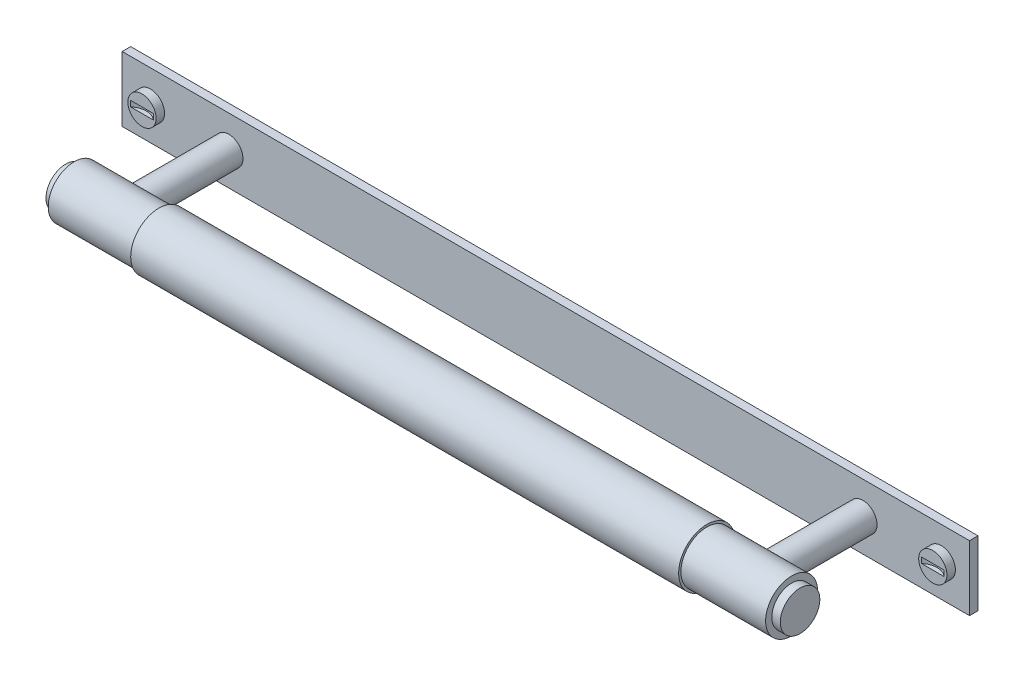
ISO-10303-21;
HEADER;
FILE_DESCRIPTION(('STEP AP214'),'2;1');
FILE_NAME('part.step','',(''),(''),'','','');
FILE_SCHEMA(('AUTOMOTIVE_DESIGN { 1 0 10303 214 1 1 1 1 }'));
ENDSEC;
DATA;
#1=APPLICATION_CONTEXT('core data for automotive mechanical design processes');
#2=APPLICATION_PROTOCOL_DEFINITION('international standard','automotive_design',2000,#1);
#3=PRODUCT_CONTEXT('',#1,'mechanical');
#4=PRODUCT('Part','Part','',(#3));
#5=PRODUCT_RELATED_PRODUCT_CATEGORY('part','',(#4));
#6=PRODUCT_DEFINITION_FORMATION('','',#4);
#7=PRODUCT_DEFINITION_CONTEXT('part definition',#1,'design');
#8=PRODUCT_DEFINITION('design','',#6,#7);
#9=PRODUCT_DEFINITION_SHAPE('','',#8);
#10=(LENGTH_UNIT() NAMED_UNIT(*) SI_UNIT(.MILLI.,.METRE.));
#11=(NAMED_UNIT(*) PLANE_ANGLE_UNIT() SI_UNIT($,.RADIAN.));
#12=(NAMED_UNIT(*) SI_UNIT($,.STERADIAN.) SOLID_ANGLE_UNIT());
#13=UNCERTAINTY_MEASURE_WITH_UNIT(LENGTH_MEASURE(1.E-05),#10,'distance_accuracy_value','');
#14=(GEOMETRIC_REPRESENTATION_CONTEXT(3) GLOBAL_UNCERTAINTY_ASSIGNED_CONTEXT((#13)) GLOBAL_UNIT_ASSIGNED_CONTEXT((#10,
#11,#12)) REPRESENTATION_CONTEXT('',''));
#15=CARTESIAN_POINT('',(0.,0.,0.));
#16=DIRECTION('',(0.,0.,1.));
#17=DIRECTION('',(1.,0.,0.));
#18=AXIS2_PLACEMENT_3D('',#15,#16,#17);
#19=CARTESIAN_POINT('',(150.,-11.5,-40.));
#20=DIRECTION('',(0.,0.,-1.));
#21=DIRECTION('',(-1.,0.,0.));
#22=AXIS2_PLACEMENT_3D('',#19,#20,#21);
#23=PLANE('',#22);
#24=CARTESIAN_POINT('',(-140.,0.,-40.));
#25=DIRECTION('',(0.,0.,-1.));
#26=DIRECTION('',(-1.,0.,0.));
#27=AXIS2_PLACEMENT_3D('',#24,#25,#26);
#28=CIRCLE('',#27,4.99999999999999);
#29=CARTESIAN_POINT('',(-145.,0.,-40.));
#30=VERTEX_POINT('',#29);
#31=EDGE_CURVE('E112',#30,#30,#28,.T.);
#32=ORIENTED_EDGE('',*,*,#31,.T.);
#33=EDGE_LOOP('',(#32));
#34=FACE_BOUND('',#33,.T.);
#35=CARTESIAN_POINT('',(112.25,0.,-40.));
#36=DIRECTION('',(0.,0.,-1.));
#37=DIRECTION('',(-1.,0.,0.));
#38=AXIS2_PLACEMENT_3D('',#35,#36,#37);
#39=CIRCLE('',#38,4.99999999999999);
#40=CARTESIAN_POINT('',(107.25,0.,-40.));
#41=VERTEX_POINT('',#40);
#42=EDGE_CURVE('E166',#41,#41,#39,.T.);
#43=ORIENTED_EDGE('',*,*,#42,.T.);
#44=EDGE_LOOP('',(#43));
#45=FACE_BOUND('',#44,.T.);
#46=DIRECTION('',(0.,-1.,0.));
#47=VECTOR('',#46,1.);
#48=CARTESIAN_POINT('',(-150.,-11.5,-40.));
#49=LINE('',#48,#47);
#50=CARTESIAN_POINT('',(-150.,11.5,-40.));
#51=VERTEX_POINT('',#50);
#52=CARTESIAN_POINT('',(-150.,-11.5,-40.));
#53=VERTEX_POINT('',#52);
#54=EDGE_CURVE('E149',#51,#53,#49,.T.);
#55=ORIENTED_EDGE('',*,*,#54,.T.);
#56=DIRECTION('',(-1.,0.,0.));
#57=VECTOR('',#56,1.);
#58=CARTESIAN_POINT('',(150.,-11.5,-40.));
#59=LINE('',#58,#57);
#60=CARTESIAN_POINT('',(150.,-11.5,-40.));
#61=VERTEX_POINT('',#60);
#62=EDGE_CURVE('E154',#61,#53,#59,.T.);
#63=ORIENTED_EDGE('',*,*,#62,.F.);
#64=DIRECTION('',(0.,-1.,0.));
#65=VECTOR('',#64,1.);
#66=CARTESIAN_POINT('',(150.,-11.5,-40.));
#67=LINE('',#66,#65);
#68=CARTESIAN_POINT('',(150.,11.5,-40.));
#69=VERTEX_POINT('',#68);
#70=EDGE_CURVE('E140',#69,#61,#67,.T.);
#71=ORIENTED_EDGE('',*,*,#70,.F.);
#72=DIRECTION('',(-1.,0.,0.));
#73=VECTOR('',#72,1.);
#74=CARTESIAN_POINT('',(150.,11.5,-40.));
#75=LINE('',#74,#73);
#76=EDGE_CURVE('E157',#69,#51,#75,.T.);
#77=ORIENTED_EDGE('',*,*,#76,.T.);
#78=EDGE_LOOP('',(#55,#63,#71,#77));
#79=FACE_BOUND('',#78,.T.);
#80=CARTESIAN_POINT('',(-112.25,0.,-40.));
#81=DIRECTION('',(0.,0.,-1.));
#82=DIRECTION('',(-1.,0.,0.));
#83=AXIS2_PLACEMENT_3D('',#80,#81,#82);
#84=CIRCLE('',#83,4.99999999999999);
#85=CARTESIAN_POINT('',(-117.25,0.,-40.));
#86=VERTEX_POINT('',#85);
#87=EDGE_CURVE('E163',#86,#86,#84,.F.);
#88=ORIENTED_EDGE('',*,*,#87,.F.);
#89=EDGE_LOOP('',(#88));
#90=FACE_BOUND('',#89,.T.);
#91=CARTESIAN_POINT('',(140.,0.,-40.));
#92=DIRECTION('',(0.,0.,-1.));
#93=DIRECTION('',(-1.,0.,0.));
#94=AXIS2_PLACEMENT_3D('',#91,#92,#93);
#95=CIRCLE('',#94,4.99999999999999);
#96=CARTESIAN_POINT('',(135.,0.,-40.));
#97=VERTEX_POINT('',#96);
#98=EDGE_CURVE('E286',#97,#97,#95,.F.);
#99=ORIENTED_EDGE('',*,*,#98,.F.);
#100=EDGE_LOOP('',(#99));
#101=FACE_BOUND('',#100,.T.);
#102=ADVANCED_FACE('F33',(#34,#45,#79,#90,#101),#23,.F.);
#103=CARTESIAN_POINT('',(127.,0.,0.));
#104=DIRECTION('',(-1.,0.,0.));
#105=DIRECTION('',(0.,0.,1.));
#106=AXIS2_PLACEMENT_3D('',#103,#104,#105);
#107=CYLINDRICAL_SURFACE('',#106,9.2);
#108=CARTESIAN_POINT('',(97.,0.,0.));
#109=DIRECTION('',(1.,0.,0.));
#110=DIRECTION('',(0.,0.,-1.));
#111=AXIS2_PLACEMENT_3D('',#108,#109,#110);
#112=CIRCLE('',#111,9.2);
#113=CARTESIAN_POINT('',(97.,0.,-9.2));
#114=VERTEX_POINT('',#113);
#115=EDGE_CURVE('E182',#114,#114,#112,.T.);
#116=ORIENTED_EDGE('',*,*,#115,.T.);
#117=EDGE_LOOP('',(#116));
#118=FACE_BOUND('',#117,.T.);
#119=CARTESIAN_POINT('',(127.,0.,0.));
#120=DIRECTION('',(1.,0.,0.));
#121=DIRECTION('',(0.,0.,-1.));
#122=AXIS2_PLACEMENT_3D('',#119,#120,#121);
#123=CIRCLE('',#122,9.2);
#124=CARTESIAN_POINT('',(127.,0.,-9.2));
#125=VERTEX_POINT('',#124);
#126=EDGE_CURVE('E185',#125,#125,#123,.T.);
#127=ORIENTED_EDGE('',*,*,#126,.F.);
#128=EDGE_LOOP('',(#127));
#129=FACE_BOUND('',#128,.T.);
#130=CARTESIAN_POINT('',(117.25,0.,-9.2));
#131=CARTESIAN_POINT('',(117.250001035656,-0.130074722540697,-9.20000090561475));
#132=CARTESIAN_POINT('',(117.244919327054,-0.260136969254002,-9.19723589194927));
#133=CARTESIAN_POINT('',(117.224659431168,-0.51928549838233,-9.18624856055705));
#134=CARTESIAN_POINT('',(117.209478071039,-0.648371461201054,-9.17802452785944));
#135=CARTESIAN_POINT('',(117.169189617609,-0.904665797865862,-9.15631689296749));
#136=CARTESIAN_POINT('',(117.144072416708,-1.03187212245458,-9.14282793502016));
#137=CARTESIAN_POINT('',(117.084208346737,-1.28341476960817,-9.11092364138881));
#138=CARTESIAN_POINT('',(117.04945754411,-1.40774989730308,-9.0925062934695));
#139=CARTESIAN_POINT('',(116.970895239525,-1.65213298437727,-9.05128374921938));
#140=CARTESIAN_POINT('',(116.927125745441,-1.77219789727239,-9.02849892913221));
#141=CARTESIAN_POINT('',(116.83086498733,-2.00796183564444,-8.9790104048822));
#142=CARTESIAN_POINT('',(116.778370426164,-2.12365919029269,-8.95230521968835));
#143=CARTESIAN_POINT('',(116.608525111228,-2.46316888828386,-8.86719116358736));
#144=CARTESIAN_POINT('',(116.478734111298,-2.67964052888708,-8.80374126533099));
#145=CARTESIAN_POINT('',(116.179944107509,-3.10276985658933,-8.66405646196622));
#146=CARTESIAN_POINT('',(116.008884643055,-3.30776927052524,-8.58724663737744));
#147=CARTESIAN_POINT('',(115.636938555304,-3.68774436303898,-8.43106083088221));
#148=CARTESIAN_POINT('',(115.436025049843,-3.86269267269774,-8.35168258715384));
#149=CARTESIAN_POINT('',(114.986960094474,-4.19453179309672,-8.19042783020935));
#150=CARTESIAN_POINT('',(114.736128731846,-4.34809630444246,-8.10903821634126));
#151=CARTESIAN_POINT('',(114.340003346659,-4.54463175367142,-7.99949849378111));
#152=CARTESIAN_POINT('',(114.20460087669,-4.60452242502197,-7.96506681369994));
#153=CARTESIAN_POINT('',(113.927917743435,-4.7123873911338,-7.90172843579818));
#154=CARTESIAN_POINT('',(113.786640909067,-4.76036931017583,-7.87281820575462));
#155=CARTESIAN_POINT('',(113.508188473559,-4.84114175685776,-7.82339132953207));
#156=CARTESIAN_POINT('',(113.371306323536,-4.87469290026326,-7.80246375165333));
#157=CARTESIAN_POINT('',(113.094408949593,-4.9302019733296,-7.76750851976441));
#158=CARTESIAN_POINT('',(112.954395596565,-4.95216664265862,-7.75347685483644));
#159=CARTESIAN_POINT('',(112.67258350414,-4.98412633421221,-7.73297147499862));
#160=CARTESIAN_POINT('',(112.530786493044,-4.99413215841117,-7.72649093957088));
#161=CARTESIAN_POINT('',(112.246722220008,-5.0020165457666,-7.72138953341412));
#162=CARTESIAN_POINT('',(112.104455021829,-4.99989669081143,-7.72276763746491));
#163=CARTESIAN_POINT('',(111.841925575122,-4.98478878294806,-7.73252471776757));
#164=CARTESIAN_POINT('',(111.721523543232,-4.97345607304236,-7.73983711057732));
#165=CARTESIAN_POINT('',(111.482260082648,-4.942179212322,-7.75984601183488));
#166=CARTESIAN_POINT('',(111.363399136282,-4.92223242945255,-7.77254416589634));
#167=CARTESIAN_POINT('',(111.12803831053,-4.87397481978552,-7.80289558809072));
#168=CARTESIAN_POINT('',(111.011538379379,-4.84566417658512,-7.82054874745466));
#169=CARTESIAN_POINT('',(110.781543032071,-4.7809962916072,-7.86024868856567));
#170=CARTESIAN_POINT('',(110.668048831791,-4.74463584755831,-7.88229721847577));
#171=CARTESIAN_POINT('',(110.328154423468,-4.62225510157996,-7.95511924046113));
#172=CARTESIAN_POINT('',(110.107319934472,-4.52396510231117,-8.01188661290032));
#173=CARTESIAN_POINT('',(109.684260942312,-4.29821090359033,-8.1352249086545));
#174=CARTESIAN_POINT('',(109.482044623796,-4.17073395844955,-8.20180011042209));
#175=CARTESIAN_POINT('',(109.069163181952,-3.86749973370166,-8.34955553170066));
#176=CARTESIAN_POINT('',(108.86196454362,-3.68733528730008,-8.43140910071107));
#177=CARTESIAN_POINT('',(108.479057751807,-3.29471585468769,-8.59242600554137));
#178=CARTESIAN_POINT('',(108.303370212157,-3.08223989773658,-8.67158755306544));
#179=CARTESIAN_POINT('',(108.061812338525,-2.73508983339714,-8.78495686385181));
#180=CARTESIAN_POINT('',(107.982990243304,-2.61045949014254,-8.82288451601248));
#181=CARTESIAN_POINT('',(107.836257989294,-2.35386813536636,-8.89477478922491));
#182=CARTESIAN_POINT('',(107.768343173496,-2.22191028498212,-8.92873910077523));
#183=CARTESIAN_POINT('',(107.644183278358,-1.95155644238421,-8.99170105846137));
#184=CARTESIAN_POINT('',(107.587932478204,-1.81316364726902,-9.02070113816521));
#185=CARTESIAN_POINT('',(107.487782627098,-1.53091383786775,-9.07286528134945));
#186=CARTESIAN_POINT('',(107.443881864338,-1.38705758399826,-9.09603015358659));
#187=CARTESIAN_POINT('',(107.372513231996,-1.10853590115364,-9.13395050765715));
#188=CARTESIAN_POINT('',(107.343906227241,-0.974240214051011,-9.14928303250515));
#189=CARTESIAN_POINT('',(107.297792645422,-0.703227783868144,-9.17409277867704));
#190=CARTESIAN_POINT('',(107.280284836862,-0.566511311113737,-9.18357064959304));
#191=CARTESIAN_POINT('',(107.256625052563,-0.291879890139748,-9.19639574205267));
#192=CARTESIAN_POINT('',(107.250467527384,-0.15396556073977,-9.19974595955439));
#193=CARTESIAN_POINT('',(107.24958386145,0.121906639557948,-9.20022611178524));
#194=CARTESIAN_POINT('',(107.25485701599,0.259864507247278,-9.19735642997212));
#195=CARTESIAN_POINT('',(107.275708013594,0.521504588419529,-9.18605000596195));
#196=CARTESIAN_POINT('',(107.290256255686,0.645294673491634,-9.17816969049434));
#197=CARTESIAN_POINT('',(107.328472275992,0.891088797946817,-9.15757479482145));
#198=CARTESIAN_POINT('',(107.352142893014,1.01309226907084,-9.14485870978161));
#199=CARTESIAN_POINT('',(107.408333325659,1.25443425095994,-9.11488727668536));
#200=CARTESIAN_POINT('',(107.440850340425,1.37377359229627,-9.09763336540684));
#201=CARTESIAN_POINT('',(107.514396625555,1.60912592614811,-9.05897178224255));
#202=CARTESIAN_POINT('',(107.555429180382,1.72513761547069,-9.0375625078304));
#203=CARTESIAN_POINT('',(107.692832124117,2.07244825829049,-8.9666859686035));
#204=CARTESIAN_POINT('',(107.80222449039,2.29754525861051,-8.91127618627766));
#205=CARTESIAN_POINT('',(108.051555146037,2.72668339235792,-8.78949008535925));
#206=CARTESIAN_POINT('',(108.191504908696,2.93071657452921,-8.72310964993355));
#207=CARTESIAN_POINT('',(108.515646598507,3.33604084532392,-8.5768397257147));
#208=CARTESIAN_POINT('',(108.703016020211,3.53454639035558,-8.49626779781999));
#209=CARTESIAN_POINT('',(109.107841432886,3.89884933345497,-8.3353877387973));
#210=CARTESIAN_POINT('',(109.325327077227,4.06461409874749,-8.25507994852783));
#211=CARTESIAN_POINT('',(109.679615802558,4.29124185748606,-8.13837911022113));
#212=CARTESIAN_POINT('',(109.807207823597,4.36516170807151,-8.0988551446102));
#213=CARTESIAN_POINT('',(110.069309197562,4.50182228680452,-8.02369412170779));
#214=CARTESIAN_POINT('',(110.203815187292,4.56456838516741,-7.98805520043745));
#215=CARTESIAN_POINT('',(110.478867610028,4.67816332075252,-7.92206455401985));
#216=CARTESIAN_POINT('',(110.619408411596,4.72902297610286,-7.89170802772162));
#217=CARTESIAN_POINT('',(110.905644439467,4.81821167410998,-7.83757391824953));
#218=CARTESIAN_POINT('',(111.051338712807,4.85654302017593,-7.8137951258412));
#219=CARTESIAN_POINT('',(111.332218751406,4.91693572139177,-7.77591708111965));
#220=CARTESIAN_POINT('',(111.467045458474,4.94021834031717,-7.76110050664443));
#221=CARTESIAN_POINT('',(111.738723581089,4.97567628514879,-7.7384167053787));
#222=CARTESIAN_POINT('',(111.875574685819,4.98785329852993,-7.73054842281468));
#223=CARTESIAN_POINT('',(112.149954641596,5.00088423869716,-7.72212521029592));
#224=CARTESIAN_POINT('',(112.287483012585,5.0017452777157,-7.72156568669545));
#225=CARTESIAN_POINT('',(112.561968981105,4.99214702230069,-7.72777464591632));
#226=CARTESIAN_POINT('',(112.698926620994,4.98168858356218,-7.73454257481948));
#227=CARTESIAN_POINT('',(112.953194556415,4.95173663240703,-7.7537456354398));
#228=CARTESIAN_POINT('',(113.070732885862,4.93360287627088,-7.7653243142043));
#229=CARTESIAN_POINT('',(113.303669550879,4.88915719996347,-7.79338335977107));
#230=CARTESIAN_POINT('',(113.419067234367,4.86284282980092,-7.80986519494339));
#231=CARTESIAN_POINT('',(113.760997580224,4.77204459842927,-7.86592091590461));
#232=CARTESIAN_POINT('',(113.983409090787,4.69568852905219,-7.91211668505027));
#233=CARTESIAN_POINT('',(114.426159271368,4.50841400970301,-8.02038246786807));
#234=CARTESIAN_POINT('',(114.64549505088,4.3956298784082,-8.08326570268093));
#235=CARTESIAN_POINT('',(115.063636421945,4.14046696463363,-8.21688922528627));
#236=CARTESIAN_POINT('',(115.262430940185,3.99807234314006,-8.28763370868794));
#237=CARTESIAN_POINT('',(115.665342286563,3.66254871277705,-8.44184811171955));
#238=CARTESIAN_POINT('',(115.86567297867,3.46499766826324,-8.52561746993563));
#239=CARTESIAN_POINT('',(116.231654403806,3.03735701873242,-8.68715056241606));
#240=CARTESIAN_POINT('',(116.397281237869,2.80724517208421,-8.76491013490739));
#241=CARTESIAN_POINT('',(116.61800821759,2.43762496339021,-8.87216065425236));
#242=CARTESIAN_POINT('',(116.687800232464,2.3081801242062,-8.90679581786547));
#243=CARTESIAN_POINT('',(116.816072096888,2.04271439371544,-8.97139528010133));
#244=CARTESIAN_POINT('',(116.874557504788,1.90669677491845,-9.00136187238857));
#245=CARTESIAN_POINT('',(116.979411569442,1.62929850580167,-9.05567934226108));
#246=CARTESIAN_POINT('',(117.025803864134,1.48792894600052,-9.0800411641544));
#247=CARTESIAN_POINT('',(117.10595335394,1.20079805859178,-9.12245171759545));
#248=CARTESIAN_POINT('',(117.139717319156,1.05503912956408,-9.1405038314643));
#249=CARTESIAN_POINT('',(117.194445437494,0.758588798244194,-9.16989641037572));
#250=CARTESIAN_POINT('',(117.215246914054,0.60785876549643,-9.18115152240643));
#251=CARTESIAN_POINT('',(117.243023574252,0.304746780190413,-9.19620277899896));
#252=CARTESIAN_POINT('',(117.24999878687,0.152364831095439,-9.1999989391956));
#253=CARTESIAN_POINT('',(117.25,0.,-9.2));
#254=B_SPLINE_CURVE_WITH_KNOTS('',3,(#130,#131,#132,#133,#134,#135,#136,#137,#138,#139,#140,
#141,#142,#143,#144,#145,#146,#147,#148,#149,#150,#151,#152,#153,#154,#155,#156,#157,#158,#159,
#160,#161,#162,#163,#164,#165,#166,#167,#168,#169,#170,#171,#172,#173,#174,#175,#176,#177,#178,
#179,#180,#181,#182,#183,#184,#185,#186,#187,#188,#189,#190,#191,#192,#193,#194,#195,#196,#197,
#198,#199,#200,#201,#202,#203,#204,#205,#206,#207,#208,#209,#210,#211,#212,#213,#214,#215,#216,
#217,#218,#219,#220,#221,#222,#223,#224,#225,#226,#227,#228,#229,#230,#231,#232,#233,#234,#235,
#236,#237,#238,#239,#240,#241,#242,#243,#244,#245,#246,#247,#248,#249,#250,#251,#252,#253),
.UNSPECIFIED.,.T.,.F.,(4,2,2,2,2,2,2,2,2,2,2,2,2,2,2,2,2,2,2,2,2,2,2,2,2,2,2,2,2,2,2,2,2,2,2,2,
2,2,2,2,2,2,2,2,2,2,2,2,2,2,2,2,2,2,2,2,2,2,2,2,2,4),(0.,0.390074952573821,0.780272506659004,
1.17086802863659,1.56162327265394,1.95059798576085,2.33972002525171,3.11719990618,
3.94734927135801,4.77825072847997,5.68860389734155,6.14407900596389,6.59926175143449,
7.02606566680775,7.45262104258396,7.87879083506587,8.30490503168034,8.66793889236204,
9.0310837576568,9.39422065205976,9.75750226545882,10.4992817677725,11.2413858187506,
12.0973849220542,12.9539419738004,13.4102132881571,13.8662892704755,14.3221410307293,
14.7779295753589,15.1918463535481,15.6057171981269,16.0193856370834,16.4330285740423,
16.8072633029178,17.1816145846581,17.5558474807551,17.9302249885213,18.6957960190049,
19.4616549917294,20.3120011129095,21.1631905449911,21.6206680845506,22.0779251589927,
22.5347644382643,22.9915196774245,23.4037762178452,23.8159701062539,24.2279049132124,
24.6398085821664,24.9978688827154,25.3560365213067,26.0719476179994,26.8327119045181,
27.5938841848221,28.4707847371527,29.3482872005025,29.8010085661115,30.2535068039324,
30.7051138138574,31.1564783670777,31.6133990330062,32.0703187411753),.UNSPECIFIED.);
#255=CARTESIAN_POINT('',(117.25,0.,-9.2));
#256=VERTEX_POINT('',#255);
#257=EDGE_CURVE('E206',#256,#256,#254,.T.);
#258=ORIENTED_EDGE('',*,*,#257,.F.);
#259=EDGE_LOOP('',(#258));
#260=FACE_BOUND('',#259,.T.);
#261=ADVANCED_FACE('F242',(#118,#129,#260),#107,.T.);
#262=CARTESIAN_POINT('',(127.,0.,0.));
#263=DIRECTION('',(1.,0.,0.));
#264=DIRECTION('',(0.,0.,-1.));
#265=AXIS2_PLACEMENT_3D('',#262,#263,#264);
#266=PLANE('',#265);
#267=ORIENTED_EDGE('',*,*,#126,.T.);
#268=EDGE_LOOP('',(#267));
#269=FACE_BOUND('',#268,.T.);
#270=CARTESIAN_POINT('',(127.,0.,0.));
#271=DIRECTION('',(1.,0.,0.));
#272=DIRECTION('',(0.,0.,-1.));
#273=AXIS2_PLACEMENT_3D('',#270,#271,#272);
#274=CIRCLE('',#273,7.);
#275=CARTESIAN_POINT('',(127.,0.,-7.));
#276=VERTEX_POINT('',#275);
#277=EDGE_CURVE('E178',#276,#276,#274,.T.);
#278=ORIENTED_EDGE('',*,*,#277,.F.);
#279=EDGE_LOOP('',(#278));
#280=FACE_BOUND('',#279,.T.);
#281=ADVANCED_FACE('F248',(#269,#280),#266,.T.);
#282=CARTESIAN_POINT('',(97.,0.,0.));
#283=DIRECTION('',(1.,0.,0.));
#284=DIRECTION('',(0.,0.,-1.));
#285=AXIS2_PLACEMENT_3D('',#282,#283,#284);
#286=PLANE('',#285);
#287=CARTESIAN_POINT('',(97.,0.,0.));
#288=DIRECTION('',(1.,0.,0.));
#289=DIRECTION('',(0.,0.,-1.));
#290=AXIS2_PLACEMENT_3D('',#287,#288,#289);
#291=CIRCLE('',#290,10.);
#292=CARTESIAN_POINT('',(97.,0.,10.));
#293=VERTEX_POINT('',#292);
#294=EDGE_CURVE('E188',#293,#293,#291,.T.);
#295=ORIENTED_EDGE('',*,*,#294,.T.);
#296=EDGE_LOOP('',(#295));
#297=FACE_BOUND('',#296,.T.);
#298=ORIENTED_EDGE('',*,*,#115,.F.);
#299=EDGE_LOOP('',(#298));
#300=FACE_BOUND('',#299,.T.);
#301=ADVANCED_FACE('F474',(#297,#300),#286,.T.);
#302=CARTESIAN_POINT('',(97.,0.,0.));
#303=DIRECTION('',(-1.,0.,0.));
#304=DIRECTION('',(0.,0.,1.));
#305=AXIS2_PLACEMENT_3D('',#302,#303,#304);
#306=CYLINDRICAL_SURFACE('',#305,10.);
#307=CARTESIAN_POINT('',(-97.,0.,0.));
#308=DIRECTION('',(1.,0.,0.));
#309=DIRECTION('',(0.,0.,-1.));
#310=AXIS2_PLACEMENT_3D('',#307,#308,#309);
#311=CIRCLE('',#310,10.);
#312=CARTESIAN_POINT('',(-97.,0.,10.));
#313=VERTEX_POINT('',#312);
#314=EDGE_CURVE('E175',#313,#313,#311,.T.);
#315=CARTESIAN_POINT('',(97.,0.,10.));
#316=CARTESIAN_POINT('',(94.9791666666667,0.,10.));
#317=CARTESIAN_POINT('',(92.9583333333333,0.,10.));
#318=CARTESIAN_POINT('',(88.9166666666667,0.,10.));
#319=CARTESIAN_POINT('',(86.8958333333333,0.,10.));
#320=CARTESIAN_POINT('',(82.8541666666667,0.,10.));
#321=CARTESIAN_POINT('',(80.8333333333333,0.,10.));
#322=CARTESIAN_POINT('',(76.7916666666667,0.,10.));
#323=CARTESIAN_POINT('',(74.7708333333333,0.,10.));
#324=CARTESIAN_POINT('',(70.7291666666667,0.,10.));
#325=CARTESIAN_POINT('',(68.7083333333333,0.,10.));
#326=CARTESIAN_POINT('',(64.6666666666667,0.,10.));
#327=CARTESIAN_POINT('',(62.6458333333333,0.,10.));
#328=CARTESIAN_POINT('',(58.6041666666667,0.,10.));
#329=CARTESIAN_POINT('',(56.5833333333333,0.,10.));
#330=CARTESIAN_POINT('',(52.5416666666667,0.,10.));
#331=CARTESIAN_POINT('',(50.5208333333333,0.,10.));
#332=CARTESIAN_POINT('',(46.4791666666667,0.,10.));
#333=CARTESIAN_POINT('',(44.4583333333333,0.,10.));
#334=CARTESIAN_POINT('',(40.4166666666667,0.,10.));
#335=CARTESIAN_POINT('',(38.3958333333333,0.,10.));
#336=CARTESIAN_POINT('',(34.3541666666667,0.,10.));
#337=CARTESIAN_POINT('',(32.3333333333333,0.,10.));
#338=CARTESIAN_POINT('',(28.2916666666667,0.,10.));
#339=CARTESIAN_POINT('',(26.2708333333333,0.,10.));
#340=CARTESIAN_POINT('',(22.2291666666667,0.,10.));
#341=CARTESIAN_POINT('',(20.2083333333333,0.,10.));
#342=CARTESIAN_POINT('',(16.1666666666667,0.,10.));
#343=CARTESIAN_POINT('',(14.1458333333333,0.,10.));
#344=CARTESIAN_POINT('',(10.1041666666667,0.,10.));
#345=CARTESIAN_POINT('',(8.08333333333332,0.,10.));
#346=CARTESIAN_POINT('',(4.04166666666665,0.,10.));
#347=CARTESIAN_POINT('',(2.02083333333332,0.,10.));
#348=CARTESIAN_POINT('',(-2.02083333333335,0.,10.));
#349=CARTESIAN_POINT('',(-4.04166666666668,0.,10.));
#350=CARTESIAN_POINT('',(-8.08333333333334,0.,10.));
#351=CARTESIAN_POINT('',(-10.1041666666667,0.,10.));
#352=CARTESIAN_POINT('',(-14.1458333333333,0.,10.));
#353=CARTESIAN_POINT('',(-16.1666666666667,0.,10.));
#354=CARTESIAN_POINT('',(-20.2083333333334,0.,10.));
#355=CARTESIAN_POINT('',(-22.2291666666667,0.,10.));
#356=CARTESIAN_POINT('',(-26.2708333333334,0.,10.));
#357=CARTESIAN_POINT('',(-28.2916666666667,0.,10.));
#358=CARTESIAN_POINT('',(-32.3333333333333,0.,10.));
#359=CARTESIAN_POINT('',(-34.3541666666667,0.,10.));
#360=CARTESIAN_POINT('',(-38.3958333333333,0.,10.));
#361=CARTESIAN_POINT('',(-40.4166666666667,0.,10.));
#362=CARTESIAN_POINT('',(-44.4583333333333,0.,10.));
#363=CARTESIAN_POINT('',(-46.4791666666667,0.,10.));
#364=CARTESIAN_POINT('',(-50.5208333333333,0.,10.));
#365=CARTESIAN_POINT('',(-52.5416666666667,0.,10.));
#366=CARTESIAN_POINT('',(-56.5833333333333,0.,10.));
#367=CARTESIAN_POINT('',(-58.6041666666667,0.,10.));
#368=CARTESIAN_POINT('',(-62.6458333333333,0.,10.));
#369=CARTESIAN_POINT('',(-64.6666666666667,0.,10.));
#370=CARTESIAN_POINT('',(-68.7083333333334,0.,10.));
#371=CARTESIAN_POINT('',(-70.7291666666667,0.,10.));
#372=CARTESIAN_POINT('',(-74.7708333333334,0.,10.));
#373=CARTESIAN_POINT('',(-76.7916666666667,0.,10.));
#374=CARTESIAN_POINT('',(-80.8333333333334,0.,10.));
#375=CARTESIAN_POINT('',(-82.8541666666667,0.,10.));
#376=CARTESIAN_POINT('',(-86.8958333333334,0.,10.));
#377=CARTESIAN_POINT('',(-88.9166666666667,0.,10.));
#378=CARTESIAN_POINT('',(-92.9583333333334,0.,10.));
#379=CARTESIAN_POINT('',(-94.9791666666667,0.,10.));
#380=CARTESIAN_POINT('',(-97.,0.,10.));
#381=B_SPLINE_CURVE_WITH_KNOTS('',3,(#315,#316,#317,#318,#319,#320,#321,#322,#323,#324,#325,
#326,#327,#328,#329,#330,#331,#332,#333,#334,#335,#336,#337,#338,#339,#340,#341,#342,#343,#344,
#345,#346,#347,#348,#349,#350,#351,#352,#353,#354,#355,#356,#357,#358,#359,#360,#361,#362,#363,
#364,#365,#366,#367,#368,#369,#370,#371,#372,#373,#374,#375,#376,#377,#378,#379,#380),
.UNSPECIFIED.,.F.,.F.,(4,2,2,2,2,2,2,2,2,2,2,2,2,2,2,2,2,2,2,2,2,2,2,2,2,2,2,2,2,2,2,2,4),(0.,
6.06250000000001,12.125,18.1875,24.25,30.3125,36.375,42.4375,48.5,54.5625,60.625,66.6875,72.75,
78.8125,84.875,90.9375,97.,103.0625,109.125,115.1875,121.25,127.3125,133.375,139.4375,145.5,
151.5625,157.625,163.6875,169.75,175.8125,181.875,187.9375,194.),.UNSPECIFIED.);
#382=EDGE_CURVE('BSEAM35',#293,#313,#381,.T.);
#383=ORIENTED_EDGE('',*,*,#294,.F.);
#384=ORIENTED_EDGE('',*,*,#314,.T.);
#385=ORIENTED_EDGE('',*,*,#382,.T.);
#386=ORIENTED_EDGE('',*,*,#382,.F.);
#387=EDGE_LOOP('',(#383,#385,#384,#386));
#388=FACE_BOUND('',#387,.T.);
#389=ADVANCED_FACE('F35',(#388),#306,.T.);
#390=CARTESIAN_POINT('',(130.,0.,0.));
#391=DIRECTION('',(-1.,0.,0.));
#392=DIRECTION('',(0.,0.,1.));
#393=AXIS2_PLACEMENT_3D('',#390,#391,#392);
#394=CYLINDRICAL_SURFACE('',#393,7.);
#395=CARTESIAN_POINT('',(130.,0.,0.));
#396=DIRECTION('',(1.,0.,0.));
#397=DIRECTION('',(0.,0.,-1.));
#398=AXIS2_PLACEMENT_3D('',#395,#396,#397);
#399=CIRCLE('',#398,7.);
#400=CARTESIAN_POINT('',(130.,0.,-7.));
#401=VERTEX_POINT('',#400);
#402=EDGE_CURVE('E179',#401,#401,#399,.T.);
#403=ORIENTED_EDGE('',*,*,#402,.F.);
#404=EDGE_LOOP('',(#403));
#405=FACE_BOUND('',#404,.T.);
#406=ORIENTED_EDGE('',*,*,#277,.T.);
#407=EDGE_LOOP('',(#406));
#408=FACE_BOUND('',#407,.T.);
#409=ADVANCED_FACE('F473',(#405,#408),#394,.T.);
#410=CARTESIAN_POINT('',(130.,0.,0.));
#411=DIRECTION('',(1.,0.,0.));
#412=DIRECTION('',(0.,0.,-1.));
#413=AXIS2_PLACEMENT_3D('',#410,#411,#412);
#414=PLANE('',#413);
#415=ORIENTED_EDGE('',*,*,#402,.T.);
#416=EDGE_LOOP('',(#415));
#417=FACE_BOUND('',#416,.T.);
#418=ADVANCED_FACE('F464',(#417),#414,.T.);
#419=CARTESIAN_POINT('',(-97.,0.,0.));
#420=DIRECTION('',(-1.,0.,0.));
#421=DIRECTION('',(0.,0.,-1.));
#422=AXIS2_PLACEMENT_3D('',#419,#420,#421);
#423=PLANE('',#422);
#424=CARTESIAN_POINT('',(-97.,0.,0.));
#425=DIRECTION('',(-1.,0.,0.));
#426=DIRECTION('',(0.,0.,1.));
#427=AXIS2_PLACEMENT_3D('',#424,#425,#426);
#428=CIRCLE('',#427,9.2);
#429=CARTESIAN_POINT('',(-97.,0.,9.2));
#430=VERTEX_POINT('',#429);
#431=EDGE_CURVE('E193',#430,#430,#428,.T.);
#432=ORIENTED_EDGE('',*,*,#431,.F.);
#433=EDGE_LOOP('',(#432));
#434=FACE_BOUND('',#433,.T.);
#435=ORIENTED_EDGE('',*,*,#314,.F.);
#436=EDGE_LOOP('',(#435));
#437=FACE_BOUND('',#436,.T.);
#438=ADVANCED_FACE('F237',(#434,#437),#423,.T.);
#439=CARTESIAN_POINT('',(-127.,0.,0.));
#440=DIRECTION('',(1.,0.,0.));
#441=DIRECTION('',(0.,0.,-1.));
#442=AXIS2_PLACEMENT_3D('',#439,#440,#441);
#443=CYLINDRICAL_SURFACE('',#442,9.2);
#444=CARTESIAN_POINT('',(-117.25,0.,-9.2));
#445=CARTESIAN_POINT('',(-117.250001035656,0.130074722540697,-9.20000090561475));
#446=CARTESIAN_POINT('',(-117.244919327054,0.260136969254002,-9.19723589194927));
#447=CARTESIAN_POINT('',(-117.224659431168,0.51928549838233,-9.18624856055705));
#448=CARTESIAN_POINT('',(-117.209478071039,0.648371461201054,-9.17802452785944));
#449=CARTESIAN_POINT('',(-117.169189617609,0.904665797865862,-9.15631689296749));
#450=CARTESIAN_POINT('',(-117.144072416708,1.03187212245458,-9.14282793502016));
#451=CARTESIAN_POINT('',(-117.084208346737,1.28341476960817,-9.11092364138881));
#452=CARTESIAN_POINT('',(-117.04945754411,1.40774989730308,-9.0925062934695));
#453=CARTESIAN_POINT('',(-116.970895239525,1.65213298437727,-9.05128374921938));
#454=CARTESIAN_POINT('',(-116.927125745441,1.77219789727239,-9.02849892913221));
#455=CARTESIAN_POINT('',(-116.83086498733,2.00796183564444,-8.9790104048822));
#456=CARTESIAN_POINT('',(-116.778370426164,2.12365919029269,-8.95230521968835));
#457=CARTESIAN_POINT('',(-116.608525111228,2.46316888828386,-8.86719116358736));
#458=CARTESIAN_POINT('',(-116.478734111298,2.67964052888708,-8.80374126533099));
#459=CARTESIAN_POINT('',(-116.179944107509,3.10276985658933,-8.66405646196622));
#460=CARTESIAN_POINT('',(-116.008884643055,3.30776927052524,-8.58724663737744));
#461=CARTESIAN_POINT('',(-115.636938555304,3.68774436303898,-8.43106083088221));
#462=CARTESIAN_POINT('',(-115.436025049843,3.86269267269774,-8.35168258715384));
#463=CARTESIAN_POINT('',(-114.986960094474,4.19453179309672,-8.19042783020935));
#464=CARTESIAN_POINT('',(-114.736128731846,4.34809630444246,-8.10903821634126));
#465=CARTESIAN_POINT('',(-114.340003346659,4.54463175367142,-7.99949849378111));
#466=CARTESIAN_POINT('',(-114.20460087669,4.60452242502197,-7.96506681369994));
#467=CARTESIAN_POINT('',(-113.927917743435,4.7123873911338,-7.90172843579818));
#468=CARTESIAN_POINT('',(-113.786640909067,4.76036931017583,-7.87281820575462));
#469=CARTESIAN_POINT('',(-113.508188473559,4.84114175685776,-7.82339132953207));
#470=CARTESIAN_POINT('',(-113.371306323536,4.87469290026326,-7.80246375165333));
#471=CARTESIAN_POINT('',(-113.094408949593,4.9302019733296,-7.76750851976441));
#472=CARTESIAN_POINT('',(-112.954395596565,4.95216664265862,-7.75347685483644));
#473=CARTESIAN_POINT('',(-112.67258350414,4.98412633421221,-7.73297147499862));
#474=CARTESIAN_POINT('',(-112.530786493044,4.99413215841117,-7.72649093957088));
#475=CARTESIAN_POINT('',(-112.246722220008,5.0020165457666,-7.72138953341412));
#476=CARTESIAN_POINT('',(-112.104455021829,4.99989669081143,-7.72276763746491));
#477=CARTESIAN_POINT('',(-111.841925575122,4.98478878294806,-7.73252471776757));
#478=CARTESIAN_POINT('',(-111.721523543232,4.97345607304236,-7.73983711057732));
#479=CARTESIAN_POINT('',(-111.482260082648,4.942179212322,-7.75984601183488));
#480=CARTESIAN_POINT('',(-111.363399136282,4.92223242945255,-7.77254416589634));
#481=CARTESIAN_POINT('',(-111.12803831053,4.87397481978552,-7.80289558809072));
#482=CARTESIAN_POINT('',(-111.011538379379,4.84566417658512,-7.82054874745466));
#483=CARTESIAN_POINT('',(-110.781543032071,4.7809962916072,-7.86024868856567));
#484=CARTESIAN_POINT('',(-110.668048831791,4.74463584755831,-7.88229721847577));
#485=CARTESIAN_POINT('',(-110.328154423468,4.62225510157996,-7.95511924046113));
#486=CARTESIAN_POINT('',(-110.107319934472,4.52396510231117,-8.01188661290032));
#487=CARTESIAN_POINT('',(-109.684260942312,4.29821090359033,-8.1352249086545));
#488=CARTESIAN_POINT('',(-109.482044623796,4.17073395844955,-8.20180011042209));
#489=CARTESIAN_POINT('',(-109.069163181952,3.86749973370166,-8.34955553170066));
#490=CARTESIAN_POINT('',(-108.86196454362,3.68733528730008,-8.43140910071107));
#491=CARTESIAN_POINT('',(-108.479057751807,3.29471585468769,-8.59242600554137));
#492=CARTESIAN_POINT('',(-108.303370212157,3.08223989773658,-8.67158755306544));
#493=CARTESIAN_POINT('',(-108.061812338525,2.73508983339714,-8.78495686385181));
#494=CARTESIAN_POINT('',(-107.982990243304,2.61045949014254,-8.82288451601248));
#495=CARTESIAN_POINT('',(-107.836257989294,2.35386813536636,-8.89477478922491));
#496=CARTESIAN_POINT('',(-107.768343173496,2.22191028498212,-8.92873910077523));
#497=CARTESIAN_POINT('',(-107.644183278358,1.95155644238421,-8.99170105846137));
#498=CARTESIAN_POINT('',(-107.587932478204,1.81316364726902,-9.02070113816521));
#499=CARTESIAN_POINT('',(-107.487782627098,1.53091383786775,-9.07286528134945));
#500=CARTESIAN_POINT('',(-107.443881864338,1.38705758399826,-9.09603015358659));
#501=CARTESIAN_POINT('',(-107.372513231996,1.10853590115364,-9.13395050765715));
#502=CARTESIAN_POINT('',(-107.343906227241,0.974240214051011,-9.14928303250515));
#503=CARTESIAN_POINT('',(-107.297792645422,0.703227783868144,-9.17409277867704));
#504=CARTESIAN_POINT('',(-107.280284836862,0.566511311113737,-9.18357064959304));
#505=CARTESIAN_POINT('',(-107.256625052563,0.291879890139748,-9.19639574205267));
#506=CARTESIAN_POINT('',(-107.250467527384,0.15396556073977,-9.19974595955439));
#507=CARTESIAN_POINT('',(-107.24958386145,-0.121906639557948,-9.20022611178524));
#508=CARTESIAN_POINT('',(-107.25485701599,-0.259864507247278,-9.19735642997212));
#509=CARTESIAN_POINT('',(-107.275708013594,-0.521504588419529,-9.18605000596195));
#510=CARTESIAN_POINT('',(-107.290256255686,-0.645294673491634,-9.17816969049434));
#511=CARTESIAN_POINT('',(-107.328472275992,-0.891088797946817,-9.15757479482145));
#512=CARTESIAN_POINT('',(-107.352142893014,-1.01309226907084,-9.14485870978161));
#513=CARTESIAN_POINT('',(-107.408333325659,-1.25443425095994,-9.11488727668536));
#514=CARTESIAN_POINT('',(-107.440850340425,-1.37377359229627,-9.09763336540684));
#515=CARTESIAN_POINT('',(-107.514396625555,-1.60912592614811,-9.05897178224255));
#516=CARTESIAN_POINT('',(-107.555429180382,-1.72513761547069,-9.0375625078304));
#517=CARTESIAN_POINT('',(-107.692832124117,-2.07244825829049,-8.9666859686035));
#518=CARTESIAN_POINT('',(-107.80222449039,-2.29754525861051,-8.91127618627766));
#519=CARTESIAN_POINT('',(-108.051555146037,-2.72668339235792,-8.78949008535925));
#520=CARTESIAN_POINT('',(-108.191504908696,-2.93071657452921,-8.72310964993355));
#521=CARTESIAN_POINT('',(-108.515646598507,-3.33604084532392,-8.5768397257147));
#522=CARTESIAN_POINT('',(-108.703016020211,-3.53454639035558,-8.49626779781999));
#523=CARTESIAN_POINT('',(-109.107841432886,-3.89884933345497,-8.3353877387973));
#524=CARTESIAN_POINT('',(-109.325327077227,-4.06461409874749,-8.25507994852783));
#525=CARTESIAN_POINT('',(-109.679615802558,-4.29124185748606,-8.13837911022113));
#526=CARTESIAN_POINT('',(-109.807207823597,-4.36516170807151,-8.0988551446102));
#527=CARTESIAN_POINT('',(-110.069309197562,-4.50182228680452,-8.02369412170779));
#528=CARTESIAN_POINT('',(-110.203815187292,-4.56456838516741,-7.98805520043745));
#529=CARTESIAN_POINT('',(-110.478867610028,-4.67816332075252,-7.92206455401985));
#530=CARTESIAN_POINT('',(-110.619408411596,-4.72902297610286,-7.89170802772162));
#531=CARTESIAN_POINT('',(-110.905644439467,-4.81821167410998,-7.83757391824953));
#532=CARTESIAN_POINT('',(-111.051338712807,-4.85654302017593,-7.8137951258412));
#533=CARTESIAN_POINT('',(-111.332218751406,-4.91693572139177,-7.77591708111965));
#534=CARTESIAN_POINT('',(-111.467045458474,-4.94021834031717,-7.76110050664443));
#535=CARTESIAN_POINT('',(-111.738723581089,-4.97567628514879,-7.7384167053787));
#536=CARTESIAN_POINT('',(-111.875574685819,-4.98785329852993,-7.73054842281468));
#537=CARTESIAN_POINT('',(-112.149954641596,-5.00088423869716,-7.72212521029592));
#538=CARTESIAN_POINT('',(-112.287483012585,-5.0017452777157,-7.72156568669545));
#539=CARTESIAN_POINT('',(-112.561968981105,-4.99214702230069,-7.72777464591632));
#540=CARTESIAN_POINT('',(-112.698926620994,-4.98168858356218,-7.73454257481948));
#541=CARTESIAN_POINT('',(-112.953194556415,-4.95173663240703,-7.7537456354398));
#542=CARTESIAN_POINT('',(-113.070732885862,-4.93360287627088,-7.7653243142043));
#543=CARTESIAN_POINT('',(-113.303669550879,-4.88915719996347,-7.79338335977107));
#544=CARTESIAN_POINT('',(-113.419067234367,-4.86284282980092,-7.80986519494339));
#545=CARTESIAN_POINT('',(-113.760997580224,-4.77204459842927,-7.86592091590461));
#546=CARTESIAN_POINT('',(-113.983409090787,-4.69568852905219,-7.91211668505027));
#547=CARTESIAN_POINT('',(-114.426159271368,-4.50841400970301,-8.02038246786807));
#548=CARTESIAN_POINT('',(-114.64549505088,-4.3956298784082,-8.08326570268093));
#549=CARTESIAN_POINT('',(-115.063636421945,-4.14046696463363,-8.21688922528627));
#550=CARTESIAN_POINT('',(-115.262430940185,-3.99807234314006,-8.28763370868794));
#551=CARTESIAN_POINT('',(-115.665342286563,-3.66254871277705,-8.44184811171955));
#552=CARTESIAN_POINT('',(-115.86567297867,-3.46499766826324,-8.52561746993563));
#553=CARTESIAN_POINT('',(-116.231654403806,-3.03735701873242,-8.68715056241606));
#554=CARTESIAN_POINT('',(-116.397281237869,-2.80724517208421,-8.76491013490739));
#555=CARTESIAN_POINT('',(-116.61800821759,-2.43762496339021,-8.87216065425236));
#556=CARTESIAN_POINT('',(-116.687800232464,-2.3081801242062,-8.90679581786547));
#557=CARTESIAN_POINT('',(-116.816072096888,-2.04271439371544,-8.97139528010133));
#558=CARTESIAN_POINT('',(-116.874557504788,-1.90669677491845,-9.00136187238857));
#559=CARTESIAN_POINT('',(-116.979411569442,-1.62929850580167,-9.05567934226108));
#560=CARTESIAN_POINT('',(-117.025803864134,-1.48792894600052,-9.0800411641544));
#561=CARTESIAN_POINT('',(-117.10595335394,-1.20079805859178,-9.12245171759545));
#562=CARTESIAN_POINT('',(-117.139717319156,-1.05503912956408,-9.1405038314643));
#563=CARTESIAN_POINT('',(-117.194445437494,-0.758588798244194,-9.16989641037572));
#564=CARTESIAN_POINT('',(-117.215246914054,-0.60785876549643,-9.18115152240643));
#565=CARTESIAN_POINT('',(-117.243023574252,-0.304746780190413,-9.19620277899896));
#566=CARTESIAN_POINT('',(-117.24999878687,-0.152364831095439,-9.1999989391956));
#567=CARTESIAN_POINT('',(-117.25,0.,-9.2));
#568=B_SPLINE_CURVE_WITH_KNOTS('',3,(#444,#445,#446,#447,#448,#449,#450,#451,#452,#453,#454,
#455,#456,#457,#458,#459,#460,#461,#462,#463,#464,#465,#466,#467,#468,#469,#470,#471,#472,#473,
#474,#475,#476,#477,#478,#479,#480,#481,#482,#483,#484,#485,#486,#487,#488,#489,#490,#491,#492,
#493,#494,#495,#496,#497,#498,#499,#500,#501,#502,#503,#504,#505,#506,#507,#508,#509,#510,#511,
#512,#513,#514,#515,#516,#517,#518,#519,#520,#521,#522,#523,#524,#525,#526,#527,#528,#529,#530,
#531,#532,#533,#534,#535,#536,#537,#538,#539,#540,#541,#542,#543,#544,#545,#546,#547,#548,#549,
#550,#551,#552,#553,#554,#555,#556,#557,#558,#559,#560,#561,#562,#563,#564,#565,#566,#567),
.UNSPECIFIED.,.T.,.F.,(4,2,2,2,2,2,2,2,2,2,2,2,2,2,2,2,2,2,2,2,2,2,2,2,2,2,2,2,2,2,2,2,2,2,2,2,
2,2,2,2,2,2,2,2,2,2,2,2,2,2,2,2,2,2,2,2,2,2,2,2,2,4),(0.,0.390074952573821,0.780272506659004,
1.17086802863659,1.56162327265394,1.95059798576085,2.33972002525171,3.11719990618,
3.94734927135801,4.77825072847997,5.68860389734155,6.14407900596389,6.59926175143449,
7.02606566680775,7.45262104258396,7.87879083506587,8.30490503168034,8.66793889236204,
9.0310837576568,9.39422065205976,9.75750226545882,10.4992817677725,11.2413858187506,
12.0973849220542,12.9539419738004,13.4102132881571,13.8662892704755,14.3221410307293,
14.7779295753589,15.1918463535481,15.6057171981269,16.0193856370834,16.4330285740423,
16.8072633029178,17.1816145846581,17.5558474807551,17.9302249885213,18.6957960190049,
19.4616549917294,20.3120011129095,21.1631905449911,21.6206680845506,22.0779251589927,
22.5347644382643,22.9915196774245,23.4037762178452,23.8159701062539,24.2279049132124,
24.6398085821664,24.9978688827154,25.3560365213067,26.0719476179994,26.8327119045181,
27.5938841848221,28.4707847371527,29.3482872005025,29.8010085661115,30.2535068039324,
30.7051138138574,31.1564783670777,31.6133990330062,32.0703187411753),.UNSPECIFIED.);
#569=CARTESIAN_POINT('',(-117.25,0.,-9.2));
#570=VERTEX_POINT('',#569);
#571=EDGE_CURVE('E199',#570,#570,#568,.T.);
#572=ORIENTED_EDGE('',*,*,#571,.F.);
#573=EDGE_LOOP('',(#572));
#574=FACE_BOUND('',#573,.T.);
#575=CARTESIAN_POINT('',(-127.,0.,0.));
#576=DIRECTION('',(1.,0.,0.));
#577=DIRECTION('',(0.,0.,-1.));
#578=AXIS2_PLACEMENT_3D('',#575,#576,#577);
#579=CIRCLE('',#578,9.2);
#580=CARTESIAN_POINT('',(-127.,0.,-9.2));
#581=VERTEX_POINT('',#580);
#582=EDGE_CURVE('E172',#581,#581,#579,.T.);
#583=ORIENTED_EDGE('',*,*,#582,.T.);
#584=EDGE_LOOP('',(#583));
#585=FACE_BOUND('',#584,.T.);
#586=ORIENTED_EDGE('',*,*,#431,.T.);
#587=EDGE_LOOP('',(#586));
#588=FACE_BOUND('',#587,.T.);
#589=ADVANCED_FACE('F212',(#574,#585,#588),#443,.T.);
#590=CARTESIAN_POINT('',(-127.,0.,0.));
#591=DIRECTION('',(-1.,0.,0.));
#592=DIRECTION('',(0.,0.,-1.));
#593=AXIS2_PLACEMENT_3D('',#590,#591,#592);
#594=PLANE('',#593);
#595=CARTESIAN_POINT('',(-127.,0.,0.));
#596=DIRECTION('',(-1.,0.,0.));
#597=DIRECTION('',(0.,0.,1.));
#598=AXIS2_PLACEMENT_3D('',#595,#596,#597);
#599=CIRCLE('',#598,7.);
#600=CARTESIAN_POINT('',(-127.,0.,7.));
#601=VERTEX_POINT('',#600);
#602=EDGE_CURVE('E196',#601,#601,#599,.T.);
#603=ORIENTED_EDGE('',*,*,#602,.F.);
#604=EDGE_LOOP('',(#603));
#605=FACE_BOUND('',#604,.T.);
#606=ORIENTED_EDGE('',*,*,#582,.F.);
#607=EDGE_LOOP('',(#606));
#608=FACE_BOUND('',#607,.T.);
#609=ADVANCED_FACE('F230',(#605,#608),#594,.T.);
#610=CARTESIAN_POINT('',(-130.,0.,0.));
#611=DIRECTION('',(1.,0.,0.));
#612=DIRECTION('',(0.,0.,-1.));
#613=AXIS2_PLACEMENT_3D('',#610,#611,#612);
#614=CYLINDRICAL_SURFACE('',#613,7.);
#615=CARTESIAN_POINT('',(-130.,0.,0.));
#616=DIRECTION('',(1.,0.,0.));
#617=DIRECTION('',(0.,0.,-1.));
#618=AXIS2_PLACEMENT_3D('',#615,#616,#617);
#619=CIRCLE('',#618,7.);
#620=CARTESIAN_POINT('',(-130.,0.,-7.));
#621=VERTEX_POINT('',#620);
#622=EDGE_CURVE('E169',#621,#621,#619,.T.);
#623=ORIENTED_EDGE('',*,*,#622,.T.);
#624=EDGE_LOOP('',(#623));
#625=FACE_BOUND('',#624,.T.);
#626=ORIENTED_EDGE('',*,*,#602,.T.);
#627=EDGE_LOOP('',(#626));
#628=FACE_BOUND('',#627,.T.);
#629=ADVANCED_FACE('F227',(#625,#628),#614,.T.);
#630=CARTESIAN_POINT('',(-130.,0.,0.));
#631=DIRECTION('',(-1.,0.,0.));
#632=DIRECTION('',(0.,0.,-1.));
#633=AXIS2_PLACEMENT_3D('',#630,#631,#632);
#634=PLANE('',#633);
#635=ORIENTED_EDGE('',*,*,#622,.F.);
#636=EDGE_LOOP('',(#635));
#637=FACE_BOUND('',#636,.T.);
#638=ADVANCED_FACE('F221',(#637),#634,.T.);
#639=CARTESIAN_POINT('',(-112.25,0.,-40.));
#640=DIRECTION('',(0.,0.,1.));
#641=DIRECTION('',(1.,0.,0.));
#642=AXIS2_PLACEMENT_3D('',#639,#640,#641);
#643=CYLINDRICAL_SURFACE('',#642,4.99999999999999);
#644=ORIENTED_EDGE('',*,*,#571,.T.);
#645=EDGE_LOOP('',(#644));
#646=FACE_BOUND('',#645,.T.);
#647=ORIENTED_EDGE('',*,*,#87,.T.);
#648=EDGE_LOOP('',(#647));
#649=FACE_BOUND('',#648,.T.);
#650=ADVANCED_FACE('F216',(#646,#649),#643,.T.);
#651=CARTESIAN_POINT('',(112.25,0.,-40.));
#652=DIRECTION('',(0.,0.,1.));
#653=DIRECTION('',(1.,0.,0.));
#654=AXIS2_PLACEMENT_3D('',#651,#652,#653);
#655=CYLINDRICAL_SURFACE('',#654,4.99999999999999);
#656=ORIENTED_EDGE('',*,*,#42,.F.);
#657=EDGE_LOOP('',(#656));
#658=FACE_BOUND('',#657,.T.);
#659=ORIENTED_EDGE('',*,*,#257,.T.);
#660=EDGE_LOOP('',(#659));
#661=FACE_BOUND('',#660,.T.);
#662=ADVANCED_FACE('F220',(#658,#661),#655,.T.);
#663=CARTESIAN_POINT('',(150.,-11.5,-43.));
#664=DIRECTION('',(0.,0.,1.));
#665=DIRECTION('',(1.,0.,0.));
#666=AXIS2_PLACEMENT_3D('',#663,#664,#665);
#667=PLANE('',#666);
#668=DIRECTION('',(0.,1.,0.));
#669=VECTOR('',#668,1.);
#670=CARTESIAN_POINT('',(-150.,-11.5,-43.));
#671=LINE('',#670,#669);
#672=CARTESIAN_POINT('',(-150.,-11.5,-43.));
#673=VERTEX_POINT('',#672);
#674=CARTESIAN_POINT('',(-150.,11.5,-43.));
#675=VERTEX_POINT('',#674);
#676=EDGE_CURVE('E133',#673,#675,#671,.T.);
#677=ORIENTED_EDGE('',*,*,#676,.T.);
#678=DIRECTION('',(-1.,0.,0.));
#679=VECTOR('',#678,1.);
#680=CARTESIAN_POINT('',(150.,11.5,-43.));
#681=LINE('',#680,#679);
#682=CARTESIAN_POINT('',(150.,11.5,-43.));
#683=VERTEX_POINT('',#682);
#684=EDGE_CURVE('E160',#683,#675,#681,.T.);
#685=ORIENTED_EDGE('',*,*,#684,.F.);
#686=DIRECTION('',(0.,1.,0.));
#687=VECTOR('',#686,1.);
#688=CARTESIAN_POINT('',(150.,-11.5,-43.));
#689=LINE('',#688,#687);
#690=CARTESIAN_POINT('',(150.,-11.5,-43.));
#691=VERTEX_POINT('',#690);
#692=EDGE_CURVE('E134',#691,#683,#689,.T.);
#693=ORIENTED_EDGE('',*,*,#692,.F.);
#694=DIRECTION('',(-1.,0.,0.));
#695=VECTOR('',#694,1.);
#696=CARTESIAN_POINT('',(150.,-11.5,-43.));
#697=LINE('',#696,#695);
#698=EDGE_CURVE('E144',#691,#673,#697,.T.);
#699=ORIENTED_EDGE('',*,*,#698,.T.);
#700=EDGE_LOOP('',(#677,#685,#693,#699));
#701=FACE_BOUND('',#700,.T.);
#702=ADVANCED_FACE('F257',(#701),#667,.F.);
#703=CARTESIAN_POINT('',(150.,11.5,-40.));
#704=DIRECTION('',(0.,-1.,0.));
#705=DIRECTION('',(0.,0.,-1.));
#706=AXIS2_PLACEMENT_3D('',#703,#704,#705);
#707=PLANE('',#706);
#708=DIRECTION('',(0.,0.,1.));
#709=VECTOR('',#708,1.);
#710=CARTESIAN_POINT('',(-150.,11.5,-40.));
#711=LINE('',#710,#709);
#712=EDGE_CURVE('E147',#675,#51,#711,.T.);
#713=ORIENTED_EDGE('',*,*,#712,.T.);
#714=ORIENTED_EDGE('',*,*,#76,.F.);
#715=DIRECTION('',(0.,0.,1.));
#716=VECTOR('',#715,1.);
#717=CARTESIAN_POINT('',(150.,11.5,-40.));
#718=LINE('',#717,#716);
#719=EDGE_CURVE('E137',#683,#69,#718,.T.);
#720=ORIENTED_EDGE('',*,*,#719,.F.);
#721=ORIENTED_EDGE('',*,*,#684,.T.);
#722=EDGE_LOOP('',(#713,#714,#720,#721));
#723=FACE_BOUND('',#722,.T.);
#724=ADVANCED_FACE('F255',(#723),#707,.F.);
#725=CARTESIAN_POINT('',(150.,-11.5,-40.));
#726=DIRECTION('',(0.,1.,0.));
#727=DIRECTION('',(0.,0.,1.));
#728=AXIS2_PLACEMENT_3D('',#725,#726,#727);
#729=PLANE('',#728);
#730=DIRECTION('',(0.,0.,-1.));
#731=VECTOR('',#730,1.);
#732=CARTESIAN_POINT('',(-150.,-11.5,-40.));
#733=LINE('',#732,#731);
#734=EDGE_CURVE('E138',#53,#673,#733,.T.);
#735=ORIENTED_EDGE('',*,*,#734,.T.);
#736=ORIENTED_EDGE('',*,*,#698,.F.);
#737=DIRECTION('',(0.,0.,-1.));
#738=VECTOR('',#737,1.);
#739=CARTESIAN_POINT('',(150.,-11.5,-40.));
#740=LINE('',#739,#738);
#741=EDGE_CURVE('E142',#61,#691,#740,.T.);
#742=ORIENTED_EDGE('',*,*,#741,.F.);
#743=ORIENTED_EDGE('',*,*,#62,.T.);
#744=EDGE_LOOP('',(#735,#736,#742,#743));
#745=FACE_BOUND('',#744,.T.);
#746=ADVANCED_FACE('F253',(#745),#729,.F.);
#747=CARTESIAN_POINT('',(150.,0.,0.));
#748=DIRECTION('',(-1.,0.,0.));
#749=DIRECTION('',(0.,0.,1.));
#750=AXIS2_PLACEMENT_3D('',#747,#748,#749);
#751=PLANE('',#750);
#752=ORIENTED_EDGE('',*,*,#692,.T.);
#753=ORIENTED_EDGE('',*,*,#719,.T.);
#754=ORIENTED_EDGE('',*,*,#70,.T.);
#755=ORIENTED_EDGE('',*,*,#741,.T.);
#756=EDGE_LOOP('',(#752,#753,#754,#755));
#757=FACE_BOUND('',#756,.T.);
#758=ADVANCED_FACE('F276',(#757),#751,.F.);
#759=CARTESIAN_POINT('',(-150.,0.,0.));
#760=DIRECTION('',(-1.,0.,0.));
#761=DIRECTION('',(0.,0.,1.));
#762=AXIS2_PLACEMENT_3D('',#759,#760,#761);
#763=PLANE('',#762);
#764=ORIENTED_EDGE('',*,*,#676,.F.);
#765=ORIENTED_EDGE('',*,*,#734,.F.);
#766=ORIENTED_EDGE('',*,*,#54,.F.);
#767=ORIENTED_EDGE('',*,*,#712,.F.);
#768=EDGE_LOOP('',(#764,#765,#766,#767));
#769=FACE_BOUND('',#768,.T.);
#770=ADVANCED_FACE('F271',(#769),#763,.T.);
#771=CARTESIAN_POINT('',(140.,0.,-37.));
#772=DIRECTION('',(0.,0.,-1.));
#773=DIRECTION('',(-1.,0.,0.));
#774=AXIS2_PLACEMENT_3D('',#771,#772,#773);
#775=CYLINDRICAL_SURFACE('',#774,4.99999999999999);
#776=CARTESIAN_POINT('',(140.,0.,-37.));
#777=DIRECTION('',(0.,0.,1.));
#778=DIRECTION('',(1.,0.,0.));
#779=AXIS2_PLACEMENT_3D('',#776,#777,#778);
#780=CIRCLE('',#779,4.99999999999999);
#781=CARTESIAN_POINT('',(145.,0.,-37.));
#782=VERTEX_POINT('',#781);
#783=EDGE_CURVE('E128',#782,#782,#780,.T.);
#784=ORIENTED_EDGE('',*,*,#783,.F.);
#785=EDGE_LOOP('',(#784));
#786=FACE_BOUND('',#785,.T.);
#787=ORIENTED_EDGE('',*,*,#98,.T.);
#788=EDGE_LOOP('',(#787));
#789=FACE_BOUND('',#788,.T.);
#790=ADVANCED_FACE('F320',(#786,#789),#775,.T.);
#791=CARTESIAN_POINT('',(140.,0.,-37.));
#792=DIRECTION('',(0.,0.,1.));
#793=DIRECTION('',(1.,0.,0.));
#794=AXIS2_PLACEMENT_3D('',#791,#792,#793);
#795=PLANE('',#794);
#796=DIRECTION('',(1.,0.,0.));
#797=VECTOR('',#796,1.);
#798=CARTESIAN_POINT('',(140.,-1.,-37.));
#799=LINE('',#798,#797);
#800=CARTESIAN_POINT('',(136.,-1.,-37.));
#801=VERTEX_POINT('',#800);
#802=CARTESIAN_POINT('',(144.,-1.,-37.));
#803=VERTEX_POINT('',#802);
#804=EDGE_CURVE('E290',#801,#803,#799,.T.);
#805=ORIENTED_EDGE('',*,*,#804,.F.);
#806=DIRECTION('',(0.,1.,0.));
#807=VECTOR('',#806,1.);
#808=CARTESIAN_POINT('',(136.,-1.,-37.));
#809=LINE('',#808,#807);
#810=CARTESIAN_POINT('',(136.,1.,-37.));
#811=VERTEX_POINT('',#810);
#812=EDGE_CURVE('E124',#801,#811,#809,.T.);
#813=ORIENTED_EDGE('',*,*,#812,.T.);
#814=DIRECTION('',(1.,0.,0.));
#815=VECTOR('',#814,1.);
#816=CARTESIAN_POINT('',(140.,1.,-37.));
#817=LINE('',#816,#815);
#818=CARTESIAN_POINT('',(144.,1.,-37.));
#819=VERTEX_POINT('',#818);
#820=EDGE_CURVE('E288',#811,#819,#817,.T.);
#821=ORIENTED_EDGE('',*,*,#820,.T.);
#822=DIRECTION('',(0.,1.,0.));
#823=VECTOR('',#822,1.);
#824=CARTESIAN_POINT('',(144.,-1.,-37.));
#825=LINE('',#824,#823);
#826=EDGE_CURVE('E126',#803,#819,#825,.T.);
#827=ORIENTED_EDGE('',*,*,#826,.F.);
#828=EDGE_LOOP('',(#805,#813,#821,#827));
#829=FACE_BOUND('',#828,.T.);
#830=ORIENTED_EDGE('',*,*,#783,.T.);
#831=EDGE_LOOP('',(#830));
#832=FACE_BOUND('',#831,.T.);
#833=ADVANCED_FACE('F302',(#829,#832),#795,.T.);
#834=CARTESIAN_POINT('',(140.,-1.,-32.5278640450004));
#835=DIRECTION('',(0.,1.,0.));
#836=DIRECTION('',(0.,0.,1.));
#837=AXIS2_PLACEMENT_3D('',#834,#835,#836);
#838=CYLINDRICAL_SURFACE('',#837,6.);
#839=CARTESIAN_POINT('',(140.,1.,-32.5278640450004));
#840=DIRECTION('',(0.,1.,0.));
#841=DIRECTION('',(0.,0.,-1.));
#842=AXIS2_PLACEMENT_3D('',#839,#840,#841);
#843=CIRCLE('',#842,6.);
#844=EDGE_CURVE('E54',#819,#811,#843,.T.);
#845=ORIENTED_EDGE('',*,*,#844,.T.);
#846=ORIENTED_EDGE('',*,*,#812,.F.);
#847=CARTESIAN_POINT('',(140.,-1.,-32.5278640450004));
#848=DIRECTION('',(0.,1.,0.));
#849=DIRECTION('',(0.,0.,-1.));
#850=AXIS2_PLACEMENT_3D('',#847,#848,#849);
#851=CIRCLE('',#850,6.);
#852=EDGE_CURVE('E121',#803,#801,#851,.T.);
#853=ORIENTED_EDGE('',*,*,#852,.F.);
#854=ORIENTED_EDGE('',*,*,#826,.T.);
#855=EDGE_LOOP('',(#845,#846,#853,#854));
#856=FACE_BOUND('',#855,.T.);
#857=ADVANCED_FACE('F301',(#856),#838,.F.);
#858=CARTESIAN_POINT('',(140.,-1.,-32.5278640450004));
#859=DIRECTION('',(0.,-1.,0.));
#860=DIRECTION('',(0.,0.,-1.));
#861=AXIS2_PLACEMENT_3D('',#858,#859,#860);
#862=PLANE('',#861);
#863=ORIENTED_EDGE('',*,*,#804,.T.);
#864=ORIENTED_EDGE('',*,*,#852,.T.);
#865=EDGE_LOOP('',(#863,#864));
#866=FACE_BOUND('',#865,.T.);
#867=ADVANCED_FACE('F297',(#866),#862,.F.);
#868=CARTESIAN_POINT('',(140.,1.,-32.5278640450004));
#869=DIRECTION('',(0.,-1.,0.));
#870=DIRECTION('',(0.,0.,-1.));
#871=AXIS2_PLACEMENT_3D('',#868,#869,#870);
#872=PLANE('',#871);
#873=ORIENTED_EDGE('',*,*,#844,.F.);
#874=ORIENTED_EDGE('',*,*,#820,.F.);
#875=EDGE_LOOP('',(#873,#874));
#876=FACE_BOUND('',#875,.T.);
#877=ADVANCED_FACE('F304',(#876),#872,.T.);
#878=CARTESIAN_POINT('',(-140.,0.,-37.));
#879=DIRECTION('',(0.,0.,-1.));
#880=DIRECTION('',(-1.,0.,0.));
#881=AXIS2_PLACEMENT_3D('',#878,#879,#880);
#882=CYLINDRICAL_SURFACE('',#881,4.99999999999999);
#883=CARTESIAN_POINT('',(-140.,0.,-37.));
#884=DIRECTION('',(0.,0.,-1.));
#885=DIRECTION('',(-1.,0.,0.));
#886=AXIS2_PLACEMENT_3D('',#883,#884,#885);
#887=CIRCLE('',#886,4.99999999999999);
#888=CARTESIAN_POINT('',(-145.,0.,-37.));
#889=VERTEX_POINT('',#888);
#890=EDGE_CURVE('E115',#889,#889,#887,.T.);
#891=ORIENTED_EDGE('',*,*,#890,.T.);
#892=EDGE_LOOP('',(#891));
#893=FACE_BOUND('',#892,.T.);
#894=ORIENTED_EDGE('',*,*,#31,.F.);
#895=EDGE_LOOP('',(#894));
#896=FACE_BOUND('',#895,.T.);
#897=ADVANCED_FACE('F306',(#893,#896),#882,.T.);
#898=CARTESIAN_POINT('',(-140.,0.,-37.));
#899=DIRECTION('',(0.,0.,1.));
#900=DIRECTION('',(-1.,0.,0.));
#901=AXIS2_PLACEMENT_3D('',#898,#899,#900);
#902=PLANE('',#901);
#903=DIRECTION('',(1.,0.,0.));
#904=VECTOR('',#903,1.);
#905=CARTESIAN_POINT('',(-140.,-1.,-37.));
#906=LINE('',#905,#904);
#907=CARTESIAN_POINT('',(-144.,-1.,-37.));
#908=VERTEX_POINT('',#907);
#909=CARTESIAN_POINT('',(-136.,-1.,-37.));
#910=VERTEX_POINT('',#909);
#911=EDGE_CURVE('E11',#908,#910,#906,.T.);
#912=ORIENTED_EDGE('',*,*,#911,.F.);
#913=DIRECTION('',(0.,1.,0.));
#914=VECTOR('',#913,1.);
#915=CARTESIAN_POINT('',(-144.,-1.,-37.));
#916=LINE('',#915,#914);
#917=CARTESIAN_POINT('',(-144.,1.,-37.));
#918=VERTEX_POINT('',#917);
#919=EDGE_CURVE('E97',#908,#918,#916,.T.);
#920=ORIENTED_EDGE('',*,*,#919,.T.);
#921=DIRECTION('',(1.,0.,0.));
#922=VECTOR('',#921,1.);
#923=CARTESIAN_POINT('',(-140.,1.,-37.));
#924=LINE('',#923,#922);
#925=CARTESIAN_POINT('',(-136.,1.,-37.));
#926=VERTEX_POINT('',#925);
#927=EDGE_CURVE('E41',#918,#926,#924,.T.);
#928=ORIENTED_EDGE('',*,*,#927,.T.);
#929=DIRECTION('',(0.,1.,0.));
#930=VECTOR('',#929,1.);
#931=CARTESIAN_POINT('',(-136.,-1.,-37.));
#932=LINE('',#931,#930);
#933=EDGE_CURVE('E105',#910,#926,#932,.T.);
#934=ORIENTED_EDGE('',*,*,#933,.F.);
#935=EDGE_LOOP('',(#912,#920,#928,#934));
#936=FACE_BOUND('',#935,.T.);
#937=ORIENTED_EDGE('',*,*,#890,.F.);
#938=EDGE_LOOP('',(#937));
#939=FACE_BOUND('',#938,.T.);
#940=ADVANCED_FACE('F110',(#936,#939),#902,.T.);
#941=CARTESIAN_POINT('',(-140.,-1.,-32.5278640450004));
#942=DIRECTION('',(0.,1.,0.));
#943=DIRECTION('',(0.,0.,1.));
#944=AXIS2_PLACEMENT_3D('',#941,#942,#943);
#945=CYLINDRICAL_SURFACE('',#944,6.);
#946=CARTESIAN_POINT('',(-140.,1.,-32.5278640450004));
#947=DIRECTION('',(0.,-1.,0.));
#948=DIRECTION('',(0.,0.,-1.));
#949=AXIS2_PLACEMENT_3D('',#946,#947,#948);
#950=CIRCLE('',#949,6.);
#951=EDGE_CURVE('E47',#918,#926,#950,.T.);
#952=ORIENTED_EDGE('',*,*,#951,.F.);
#953=ORIENTED_EDGE('',*,*,#919,.F.);
#954=CARTESIAN_POINT('',(-140.,-1.,-32.5278640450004));
#955=DIRECTION('',(0.,-1.,0.));
#956=DIRECTION('',(0.,0.,-1.));
#957=AXIS2_PLACEMENT_3D('',#954,#955,#956);
#958=CIRCLE('',#957,6.);
#959=EDGE_CURVE('E100',#908,#910,#958,.T.);
#960=ORIENTED_EDGE('',*,*,#959,.T.);
#961=ORIENTED_EDGE('',*,*,#933,.T.);
#962=EDGE_LOOP('',(#952,#953,#960,#961));
#963=FACE_BOUND('',#962,.T.);
#964=ADVANCED_FACE('F99',(#963),#945,.F.);
#965=CARTESIAN_POINT('',(-140.,-1.,-32.5278640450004));
#966=DIRECTION('',(0.,-1.,0.));
#967=DIRECTION('',(0.,0.,-1.));
#968=AXIS2_PLACEMENT_3D('',#965,#966,#967);
#969=PLANE('',#968);
#970=ORIENTED_EDGE('',*,*,#911,.T.);
#971=ORIENTED_EDGE('',*,*,#959,.F.);
#972=EDGE_LOOP('',(#970,#971));
#973=FACE_BOUND('',#972,.T.);
#974=ADVANCED_FACE('F108',(#973),#969,.F.);
#975=CARTESIAN_POINT('',(-140.,1.,-32.5278640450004));
#976=DIRECTION('',(0.,-1.,0.));
#977=DIRECTION('',(0.,0.,-1.));
#978=AXIS2_PLACEMENT_3D('',#975,#976,#977);
#979=PLANE('',#978);
#980=ORIENTED_EDGE('',*,*,#951,.T.);
#981=ORIENTED_EDGE('',*,*,#927,.F.);
#982=EDGE_LOOP('',(#980,#981));
#983=FACE_BOUND('',#982,.T.);
#984=ADVANCED_FACE('F386',(#983),#979,.T.);
#985=CLOSED_SHELL('',(#102,#261,#281,#301,#389,#409,#418,#438,#589,#609,#629,#638,#650,#662,
#702,#724,#746,#758,#770,#790,#833,#857,#867,#877,#897,#940,#964,#974,#984));
#986=MANIFOLD_SOLID_BREP('B2',#985);
#987=ADVANCED_BREP_SHAPE_REPRESENTATION('',(#18,#986),#14);
#988=SHAPE_DEFINITION_REPRESENTATION(#9,#987);
ENDSEC;
END-ISO-10303-21;
